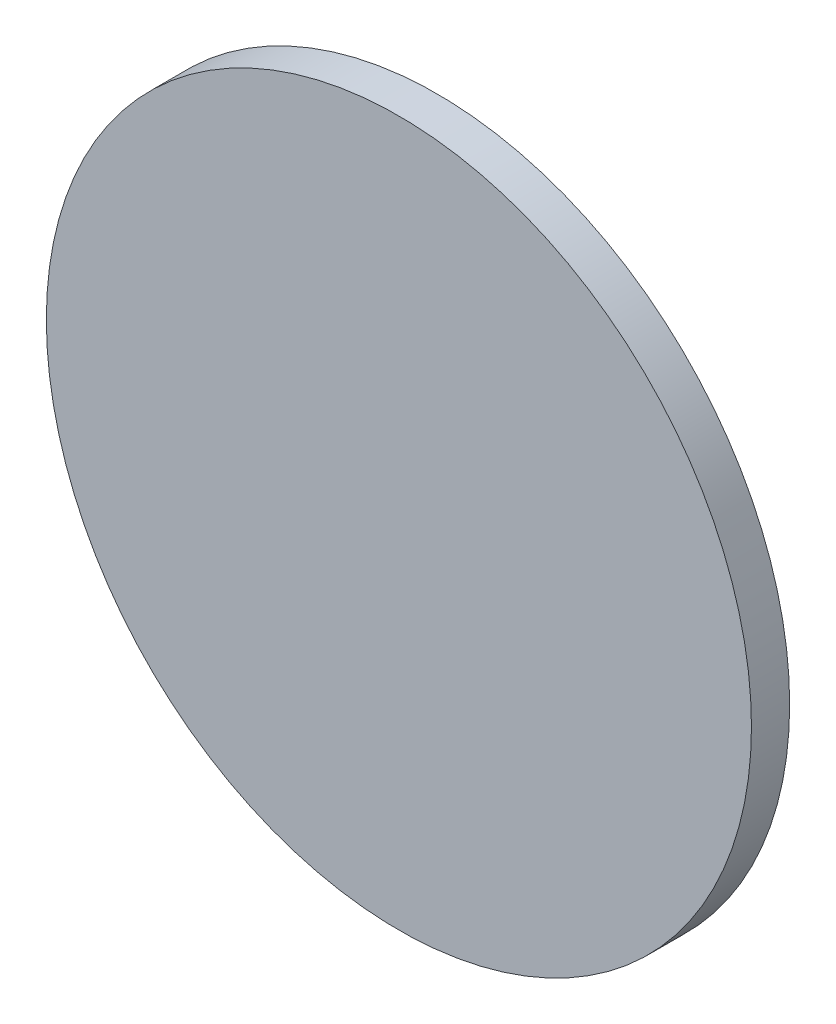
ISO-10303-21;
HEADER;
FILE_DESCRIPTION(('STEP AP214'),'2;1');
FILE_NAME('part.step','',(''),(''),'','','');
FILE_SCHEMA(('AUTOMOTIVE_DESIGN { 1 0 10303 214 1 1 1 1 }'));
ENDSEC;
DATA;
#1=APPLICATION_CONTEXT('core data for automotive mechanical design processes');
#2=APPLICATION_PROTOCOL_DEFINITION('international standard','automotive_design',2000,#1);
#3=PRODUCT_CONTEXT('',#1,'mechanical');
#4=PRODUCT('Part','Part','',(#3));
#5=PRODUCT_RELATED_PRODUCT_CATEGORY('part','',(#4));
#6=PRODUCT_DEFINITION_FORMATION('','',#4);
#7=PRODUCT_DEFINITION_CONTEXT('part definition',#1,'design');
#8=PRODUCT_DEFINITION('design','',#6,#7);
#9=PRODUCT_DEFINITION_SHAPE('','',#8);
#10=(LENGTH_UNIT() NAMED_UNIT(*) SI_UNIT(.MILLI.,.METRE.));
#11=(NAMED_UNIT(*) PLANE_ANGLE_UNIT() SI_UNIT($,.RADIAN.));
#12=(NAMED_UNIT(*) SI_UNIT($,.STERADIAN.) SOLID_ANGLE_UNIT());
#13=UNCERTAINTY_MEASURE_WITH_UNIT(LENGTH_MEASURE(1.E-05),#10,'distance_accuracy_value','');
#14=(GEOMETRIC_REPRESENTATION_CONTEXT(3) GLOBAL_UNCERTAINTY_ASSIGNED_CONTEXT((#13)) GLOBAL_UNIT_ASSIGNED_CONTEXT((#10,
#11,#12)) REPRESENTATION_CONTEXT('',''));
#15=CARTESIAN_POINT('',(0.,0.,0.));
#16=DIRECTION('',(0.,0.,1.));
#17=DIRECTION('',(1.,0.,0.));
#18=AXIS2_PLACEMENT_3D('',#15,#16,#17);
#19=CARTESIAN_POINT('',(0.,0.,5.));
#20=DIRECTION('',(0.,0.,-1.));
#21=DIRECTION('',(-1.,0.,0.));
#22=AXIS2_PLACEMENT_3D('',#19,#20,#21);
#23=CYLINDRICAL_SURFACE('',#22,46.1390088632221);
#24=CARTESIAN_POINT('',(0.,0.,5.));
#25=DIRECTION('',(0.,0.,1.));
#26=DIRECTION('',(1.,0.,0.));
#27=AXIS2_PLACEMENT_3D('',#24,#25,#26);
#28=CIRCLE('',#27,46.1390088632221);
#29=CARTESIAN_POINT('',(46.1390088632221,0.,5.));
#30=VERTEX_POINT('',#29);
#31=EDGE_CURVE('E10',#30,#30,#28,.T.);
#32=ORIENTED_EDGE('',*,*,#31,.F.);
#33=EDGE_LOOP('',(#32));
#34=FACE_BOUND('',#33,.T.);
#35=CARTESIAN_POINT('',(0.,0.,0.));
#36=DIRECTION('',(0.,0.,1.));
#37=DIRECTION('',(1.,0.,0.));
#38=AXIS2_PLACEMENT_3D('',#35,#36,#37);
#39=CIRCLE('',#38,46.1390088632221);
#40=CARTESIAN_POINT('',(46.1390088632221,0.,0.));
#41=VERTEX_POINT('',#40);
#42=EDGE_CURVE('E37',#41,#41,#39,.T.);
#43=ORIENTED_EDGE('',*,*,#42,.T.);
#44=EDGE_LOOP('',(#43));
#45=FACE_BOUND('',#44,.T.);
#46=ADVANCED_FACE('F31',(#34,#45),#23,.T.);
#47=CARTESIAN_POINT('',(0.,0.,5.));
#48=DIRECTION('',(0.,0.,1.));
#49=DIRECTION('',(1.,0.,0.));
#50=AXIS2_PLACEMENT_3D('',#47,#48,#49);
#51=PLANE('',#50);
#52=ORIENTED_EDGE('',*,*,#31,.T.);
#53=EDGE_LOOP('',(#52));
#54=FACE_BOUND('',#53,.T.);
#55=ADVANCED_FACE('F46',(#54),#51,.T.);
#56=CARTESIAN_POINT('',(0.,0.,0.));
#57=DIRECTION('',(0.,0.,1.));
#58=DIRECTION('',(1.,0.,0.));
#59=AXIS2_PLACEMENT_3D('',#56,#57,#58);
#60=PLANE('',#59);
#61=ORIENTED_EDGE('',*,*,#42,.F.);
#62=EDGE_LOOP('',(#61));
#63=FACE_BOUND('',#62,.T.);
#64=ADVANCED_FACE('F44',(#63),#60,.F.);
#65=CLOSED_SHELL('',(#46,#55,#64));
#66=MANIFOLD_SOLID_BREP('B2',#65);
#67=ADVANCED_BREP_SHAPE_REPRESENTATION('',(#18,#66),#14);
#68=SHAPE_DEFINITION_REPRESENTATION(#9,#67);
ENDSEC;
END-ISO-10303-21;
